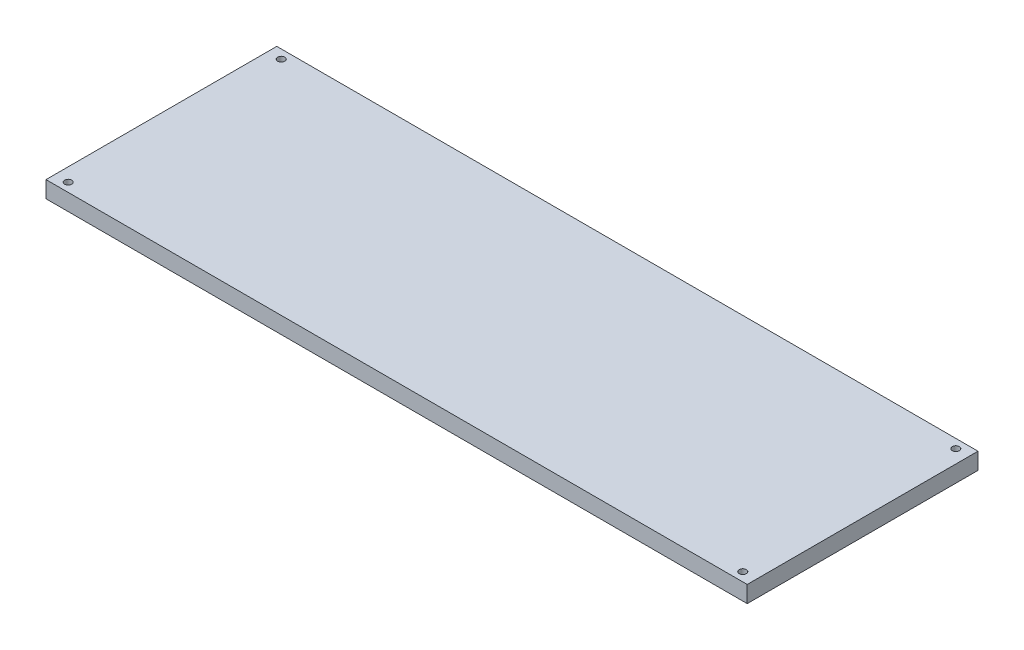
ISO-10303-21;
HEADER;
FILE_DESCRIPTION(('STEP AP214'),'2;1');
FILE_NAME('part.step','',(''),(''),'','','');
FILE_SCHEMA(('AUTOMOTIVE_DESIGN { 1 0 10303 214 1 1 1 1 }'));
ENDSEC;
DATA;
#1=APPLICATION_CONTEXT('core data for automotive mechanical design processes');
#2=APPLICATION_PROTOCOL_DEFINITION('international standard','automotive_design',2000,#1);
#3=PRODUCT_CONTEXT('',#1,'mechanical');
#4=PRODUCT('Part','Part','',(#3));
#5=PRODUCT_RELATED_PRODUCT_CATEGORY('part','',(#4));
#6=PRODUCT_DEFINITION_FORMATION('','',#4);
#7=PRODUCT_DEFINITION_CONTEXT('part definition',#1,'design');
#8=PRODUCT_DEFINITION('design','',#6,#7);
#9=PRODUCT_DEFINITION_SHAPE('','',#8);
#10=(LENGTH_UNIT() NAMED_UNIT(*) SI_UNIT(.MILLI.,.METRE.));
#11=(NAMED_UNIT(*) PLANE_ANGLE_UNIT() SI_UNIT($,.RADIAN.));
#12=(NAMED_UNIT(*) SI_UNIT($,.STERADIAN.) SOLID_ANGLE_UNIT());
#13=UNCERTAINTY_MEASURE_WITH_UNIT(LENGTH_MEASURE(1.E-05),#10,'distance_accuracy_value','');
#14=(GEOMETRIC_REPRESENTATION_CONTEXT(3) GLOBAL_UNCERTAINTY_ASSIGNED_CONTEXT((#13)) GLOBAL_UNIT_ASSIGNED_CONTEXT((#10,
#11,#12)) REPRESENTATION_CONTEXT('',''));
#15=CARTESIAN_POINT('',(0.,0.,0.));
#16=DIRECTION('',(0.,0.,1.));
#17=DIRECTION('',(1.,0.,0.));
#18=AXIS2_PLACEMENT_3D('',#15,#16,#17);
#19=CARTESIAN_POINT('',(250.825,11.90625,82.55));
#20=DIRECTION('',(-1.,0.,0.));
#21=DIRECTION('',(0.,0.,1.));
#22=AXIS2_PLACEMENT_3D('',#19,#20,#21);
#23=PLANE('',#22);
#24=DIRECTION('',(0.,0.,-1.));
#25=VECTOR('',#24,1.);
#26=CARTESIAN_POINT('',(250.825,0.,82.55));
#27=LINE('',#26,#25);
#28=CARTESIAN_POINT('',(250.825,0.,82.55));
#29=VERTEX_POINT('',#28);
#30=CARTESIAN_POINT('',(250.825,0.,-82.55));
#31=VERTEX_POINT('',#30);
#32=EDGE_CURVE('E96',#29,#31,#27,.T.);
#33=ORIENTED_EDGE('',*,*,#32,.T.);
#34=DIRECTION('',(0.,-1.,0.));
#35=VECTOR('',#34,1.);
#36=CARTESIAN_POINT('',(250.825,11.90625,-82.55));
#37=LINE('',#36,#35);
#38=CARTESIAN_POINT('',(250.825,11.90625,-82.55));
#39=VERTEX_POINT('',#38);
#40=EDGE_CURVE('E11',#39,#31,#37,.T.);
#41=ORIENTED_EDGE('',*,*,#40,.F.);
#42=DIRECTION('',(0.,0.,-1.));
#43=VECTOR('',#42,1.);
#44=CARTESIAN_POINT('',(250.825,11.90625,82.55));
#45=LINE('',#44,#43);
#46=CARTESIAN_POINT('',(250.825,11.90625,82.55));
#47=VERTEX_POINT('',#46);
#48=EDGE_CURVE('E84',#47,#39,#45,.T.);
#49=ORIENTED_EDGE('',*,*,#48,.F.);
#50=DIRECTION('',(0.,-1.,0.));
#51=VECTOR('',#50,1.);
#52=CARTESIAN_POINT('',(250.825,11.90625,82.55));
#53=LINE('',#52,#51);
#54=EDGE_CURVE('E92',#47,#29,#53,.T.);
#55=ORIENTED_EDGE('',*,*,#54,.T.);
#56=EDGE_LOOP('',(#33,#41,#49,#55));
#57=FACE_BOUND('',#56,.T.);
#58=ADVANCED_FACE('F33',(#57),#23,.F.);
#59=CARTESIAN_POINT('',(-250.825,11.90625,-82.55));
#60=DIRECTION('',(0.,0.,1.));
#61=DIRECTION('',(1.,0.,0.));
#62=AXIS2_PLACEMENT_3D('',#59,#60,#61);
#63=PLANE('',#62);
#64=DIRECTION('',(-1.,0.,0.));
#65=VECTOR('',#64,1.);
#66=CARTESIAN_POINT('',(-250.825,0.,-82.55));
#67=LINE('',#66,#65);
#68=CARTESIAN_POINT('',(-250.825,0.,-82.55));
#69=VERTEX_POINT('',#68);
#70=EDGE_CURVE('E88',#31,#69,#67,.T.);
#71=ORIENTED_EDGE('',*,*,#70,.T.);
#72=DIRECTION('',(0.,-1.,0.));
#73=VECTOR('',#72,1.);
#74=CARTESIAN_POINT('',(-250.825,11.90625,-82.55));
#75=LINE('',#74,#73);
#76=CARTESIAN_POINT('',(-250.825,11.90625,-82.55));
#77=VERTEX_POINT('',#76);
#78=EDGE_CURVE('E41',#77,#69,#75,.T.);
#79=ORIENTED_EDGE('',*,*,#78,.F.);
#80=DIRECTION('',(-1.,0.,0.));
#81=VECTOR('',#80,1.);
#82=CARTESIAN_POINT('',(-250.825,11.90625,-82.55));
#83=LINE('',#82,#81);
#84=EDGE_CURVE('E79',#39,#77,#83,.T.);
#85=ORIENTED_EDGE('',*,*,#84,.F.);
#86=ORIENTED_EDGE('',*,*,#40,.T.);
#87=EDGE_LOOP('',(#71,#79,#85,#86));
#88=FACE_BOUND('',#87,.T.);
#89=ADVANCED_FACE('F87',(#88),#63,.F.);
#90=CARTESIAN_POINT('',(-250.825,11.90625,82.55));
#91=DIRECTION('',(1.,0.,0.));
#92=DIRECTION('',(0.,0.,-1.));
#93=AXIS2_PLACEMENT_3D('',#90,#91,#92);
#94=PLANE('',#93);
#95=DIRECTION('',(0.,0.,1.));
#96=VECTOR('',#95,1.);
#97=CARTESIAN_POINT('',(-250.825,0.,82.55));
#98=LINE('',#97,#96);
#99=CARTESIAN_POINT('',(-250.825,0.,82.55));
#100=VERTEX_POINT('',#99);
#101=EDGE_CURVE('E66',#69,#100,#98,.T.);
#102=ORIENTED_EDGE('',*,*,#101,.T.);
#103=DIRECTION('',(0.,-1.,0.));
#104=VECTOR('',#103,1.);
#105=CARTESIAN_POINT('',(-250.825,11.90625,82.55));
#106=LINE('',#105,#104);
#107=CARTESIAN_POINT('',(-250.825,11.90625,82.55));
#108=VERTEX_POINT('',#107);
#109=EDGE_CURVE('E89',#108,#100,#106,.T.);
#110=ORIENTED_EDGE('',*,*,#109,.F.);
#111=DIRECTION('',(0.,0.,1.));
#112=VECTOR('',#111,1.);
#113=CARTESIAN_POINT('',(-250.825,11.90625,82.55));
#114=LINE('',#113,#112);
#115=EDGE_CURVE('E82',#77,#108,#114,.T.);
#116=ORIENTED_EDGE('',*,*,#115,.F.);
#117=ORIENTED_EDGE('',*,*,#78,.T.);
#118=EDGE_LOOP('',(#102,#110,#116,#117));
#119=FACE_BOUND('',#118,.T.);
#120=ADVANCED_FACE('F90',(#119),#94,.F.);
#121=CARTESIAN_POINT('',(-250.825,11.90625,82.55));
#122=DIRECTION('',(0.,0.,-1.));
#123=DIRECTION('',(-1.,0.,0.));
#124=AXIS2_PLACEMENT_3D('',#121,#122,#123);
#125=PLANE('',#124);
#126=DIRECTION('',(1.,0.,0.));
#127=VECTOR('',#126,1.);
#128=CARTESIAN_POINT('',(-250.825,0.,82.55));
#129=LINE('',#128,#127);
#130=EDGE_CURVE('E72',#100,#29,#129,.T.);
#131=ORIENTED_EDGE('',*,*,#130,.T.);
#132=ORIENTED_EDGE('',*,*,#54,.F.);
#133=DIRECTION('',(1.,0.,0.));
#134=VECTOR('',#133,1.);
#135=CARTESIAN_POINT('',(-250.825,11.90625,82.55));
#136=LINE('',#135,#134);
#137=EDGE_CURVE('E49',#108,#47,#136,.T.);
#138=ORIENTED_EDGE('',*,*,#137,.F.);
#139=ORIENTED_EDGE('',*,*,#109,.T.);
#140=EDGE_LOOP('',(#131,#132,#138,#139));
#141=FACE_BOUND('',#140,.T.);
#142=ADVANCED_FACE('F104',(#141),#125,.F.);
#143=CARTESIAN_POINT('',(0.,11.90625,0.));
#144=DIRECTION('',(0.,-1.,0.));
#145=DIRECTION('',(0.,0.,-1.));
#146=AXIS2_PLACEMENT_3D('',#143,#144,#145);
#147=PLANE('',#146);
#148=CARTESIAN_POINT('',(-241.3,11.90625,-76.2));
#149=DIRECTION('',(0.,1.,0.));
#150=DIRECTION('',(0.,0.,1.));
#151=AXIS2_PLACEMENT_3D('',#148,#149,#150);
#152=CIRCLE('',#151,2.55269999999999);
#153=CARTESIAN_POINT('',(-241.3,11.90625,-73.6473));
#154=VERTEX_POINT('',#153);
#155=EDGE_CURVE('E130',#154,#154,#152,.T.);
#156=ORIENTED_EDGE('',*,*,#155,.F.);
#157=EDGE_LOOP('',(#156));
#158=FACE_BOUND('',#157,.T.);
#159=CARTESIAN_POINT('',(241.3,11.90625,-76.2));
#160=DIRECTION('',(0.,1.,0.));
#161=DIRECTION('',(0.,0.,1.));
#162=AXIS2_PLACEMENT_3D('',#159,#160,#161);
#163=CIRCLE('',#162,2.55269999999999);
#164=CARTESIAN_POINT('',(241.3,11.90625,-73.6473));
#165=VERTEX_POINT('',#164);
#166=EDGE_CURVE('E124',#165,#165,#163,.T.);
#167=ORIENTED_EDGE('',*,*,#166,.F.);
#168=EDGE_LOOP('',(#167));
#169=FACE_BOUND('',#168,.T.);
#170=CARTESIAN_POINT('',(241.3,11.90625,76.2));
#171=DIRECTION('',(0.,1.,0.));
#172=DIRECTION('',(0.,0.,1.));
#173=AXIS2_PLACEMENT_3D('',#170,#171,#172);
#174=CIRCLE('',#173,2.55269999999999);
#175=CARTESIAN_POINT('',(241.3,11.90625,78.7527));
#176=VERTEX_POINT('',#175);
#177=EDGE_CURVE('E118',#176,#176,#174,.T.);
#178=ORIENTED_EDGE('',*,*,#177,.F.);
#179=EDGE_LOOP('',(#178));
#180=FACE_BOUND('',#179,.T.);
#181=CARTESIAN_POINT('',(-241.3,11.90625,76.2));
#182=DIRECTION('',(0.,1.,0.));
#183=DIRECTION('',(0.,0.,1.));
#184=AXIS2_PLACEMENT_3D('',#181,#182,#183);
#185=CIRCLE('',#184,2.55269999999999);
#186=CARTESIAN_POINT('',(-241.3,11.90625,78.7527));
#187=VERTEX_POINT('',#186);
#188=EDGE_CURVE('E112',#187,#187,#185,.T.);
#189=ORIENTED_EDGE('',*,*,#188,.F.);
#190=EDGE_LOOP('',(#189));
#191=FACE_BOUND('',#190,.T.);
#192=ORIENTED_EDGE('',*,*,#48,.T.);
#193=ORIENTED_EDGE('',*,*,#84,.T.);
#194=ORIENTED_EDGE('',*,*,#115,.T.);
#195=ORIENTED_EDGE('',*,*,#137,.T.);
#196=EDGE_LOOP('',(#192,#193,#194,#195));
#197=FACE_BOUND('',#196,.T.);
#198=ADVANCED_FACE('F80',(#158,#169,#180,#191,#197),#147,.F.);
#199=CARTESIAN_POINT('',(0.,0.,0.));
#200=DIRECTION('',(0.,-1.,0.));
#201=DIRECTION('',(0.,0.,-1.));
#202=AXIS2_PLACEMENT_3D('',#199,#200,#201);
#203=PLANE('',#202);
#204=CARTESIAN_POINT('',(-241.3,0.,-76.2));
#205=DIRECTION('',(0.,1.,0.));
#206=DIRECTION('',(0.,0.,1.));
#207=AXIS2_PLACEMENT_3D('',#204,#205,#206);
#208=CIRCLE('',#207,2.55269999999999);
#209=CARTESIAN_POINT('',(-241.3,0.,-73.6473));
#210=VERTEX_POINT('',#209);
#211=EDGE_CURVE('E127',#210,#210,#208,.T.);
#212=ORIENTED_EDGE('',*,*,#211,.T.);
#213=EDGE_LOOP('',(#212));
#214=FACE_BOUND('',#213,.T.);
#215=CARTESIAN_POINT('',(241.3,0.,-76.2));
#216=DIRECTION('',(0.,1.,0.));
#217=DIRECTION('',(0.,0.,1.));
#218=AXIS2_PLACEMENT_3D('',#215,#216,#217);
#219=CIRCLE('',#218,2.55269999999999);
#220=CARTESIAN_POINT('',(241.3,0.,-73.6473));
#221=VERTEX_POINT('',#220);
#222=EDGE_CURVE('E121',#221,#221,#219,.T.);
#223=ORIENTED_EDGE('',*,*,#222,.T.);
#224=EDGE_LOOP('',(#223));
#225=FACE_BOUND('',#224,.T.);
#226=CARTESIAN_POINT('',(241.3,0.,76.2));
#227=DIRECTION('',(0.,1.,0.));
#228=DIRECTION('',(0.,0.,1.));
#229=AXIS2_PLACEMENT_3D('',#226,#227,#228);
#230=CIRCLE('',#229,2.55269999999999);
#231=CARTESIAN_POINT('',(241.3,0.,78.7527));
#232=VERTEX_POINT('',#231);
#233=EDGE_CURVE('E115',#232,#232,#230,.T.);
#234=ORIENTED_EDGE('',*,*,#233,.T.);
#235=EDGE_LOOP('',(#234));
#236=FACE_BOUND('',#235,.T.);
#237=CARTESIAN_POINT('',(-241.3,0.,76.2));
#238=DIRECTION('',(0.,1.,0.));
#239=DIRECTION('',(0.,0.,1.));
#240=AXIS2_PLACEMENT_3D('',#237,#238,#239);
#241=CIRCLE('',#240,2.55269999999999);
#242=CARTESIAN_POINT('',(-241.3,0.,78.7527));
#243=VERTEX_POINT('',#242);
#244=EDGE_CURVE('E99',#243,#243,#241,.T.);
#245=ORIENTED_EDGE('',*,*,#244,.T.);
#246=EDGE_LOOP('',(#245));
#247=FACE_BOUND('',#246,.T.);
#248=ORIENTED_EDGE('',*,*,#32,.F.);
#249=ORIENTED_EDGE('',*,*,#130,.F.);
#250=ORIENTED_EDGE('',*,*,#101,.F.);
#251=ORIENTED_EDGE('',*,*,#70,.F.);
#252=EDGE_LOOP('',(#248,#249,#250,#251));
#253=FACE_BOUND('',#252,.T.);
#254=ADVANCED_FACE('F107',(#214,#225,#236,#247,#253),#203,.T.);
#255=CARTESIAN_POINT('',(-241.3,11.90625,76.2));
#256=DIRECTION('',(0.,1.,0.));
#257=DIRECTION('',(0.,0.,1.));
#258=AXIS2_PLACEMENT_3D('',#255,#256,#257);
#259=CYLINDRICAL_SURFACE('',#258,2.55269999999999);
#260=ORIENTED_EDGE('',*,*,#244,.F.);
#261=EDGE_LOOP('',(#260));
#262=FACE_BOUND('',#261,.T.);
#263=ORIENTED_EDGE('',*,*,#188,.T.);
#264=EDGE_LOOP('',(#263));
#265=FACE_BOUND('',#264,.T.);
#266=ADVANCED_FACE('F145',(#262,#265),#259,.F.);
#267=CARTESIAN_POINT('',(241.3,11.90625,76.2));
#268=DIRECTION('',(0.,1.,0.));
#269=DIRECTION('',(0.,0.,1.));
#270=AXIS2_PLACEMENT_3D('',#267,#268,#269);
#271=CYLINDRICAL_SURFACE('',#270,2.55269999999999);
#272=ORIENTED_EDGE('',*,*,#233,.F.);
#273=EDGE_LOOP('',(#272));
#274=FACE_BOUND('',#273,.T.);
#275=ORIENTED_EDGE('',*,*,#177,.T.);
#276=EDGE_LOOP('',(#275));
#277=FACE_BOUND('',#276,.T.);
#278=ADVANCED_FACE('F147',(#274,#277),#271,.F.);
#279=CARTESIAN_POINT('',(241.3,11.90625,-76.2));
#280=DIRECTION('',(0.,1.,0.));
#281=DIRECTION('',(0.,0.,1.));
#282=AXIS2_PLACEMENT_3D('',#279,#280,#281);
#283=CYLINDRICAL_SURFACE('',#282,2.55269999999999);
#284=ORIENTED_EDGE('',*,*,#222,.F.);
#285=EDGE_LOOP('',(#284));
#286=FACE_BOUND('',#285,.T.);
#287=ORIENTED_EDGE('',*,*,#166,.T.);
#288=EDGE_LOOP('',(#287));
#289=FACE_BOUND('',#288,.T.);
#290=ADVANCED_FACE('F154',(#286,#289),#283,.F.);
#291=CARTESIAN_POINT('',(-241.3,11.90625,-76.2));
#292=DIRECTION('',(0.,1.,0.));
#293=DIRECTION('',(0.,0.,1.));
#294=AXIS2_PLACEMENT_3D('',#291,#292,#293);
#295=CYLINDRICAL_SURFACE('',#294,2.55269999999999);
#296=ORIENTED_EDGE('',*,*,#211,.F.);
#297=EDGE_LOOP('',(#296));
#298=FACE_BOUND('',#297,.T.);
#299=ORIENTED_EDGE('',*,*,#155,.T.);
#300=EDGE_LOOP('',(#299));
#301=FACE_BOUND('',#300,.T.);
#302=ADVANCED_FACE('F134',(#298,#301),#295,.F.);
#303=CLOSED_SHELL('',(#58,#89,#120,#142,#198,#254,#266,#278,#290,#302));
#304=MANIFOLD_SOLID_BREP('B2',#303);
#305=ADVANCED_BREP_SHAPE_REPRESENTATION('',(#18,#304),#14);
#306=SHAPE_DEFINITION_REPRESENTATION(#9,#305);
ENDSEC;
END-ISO-10303-21;
